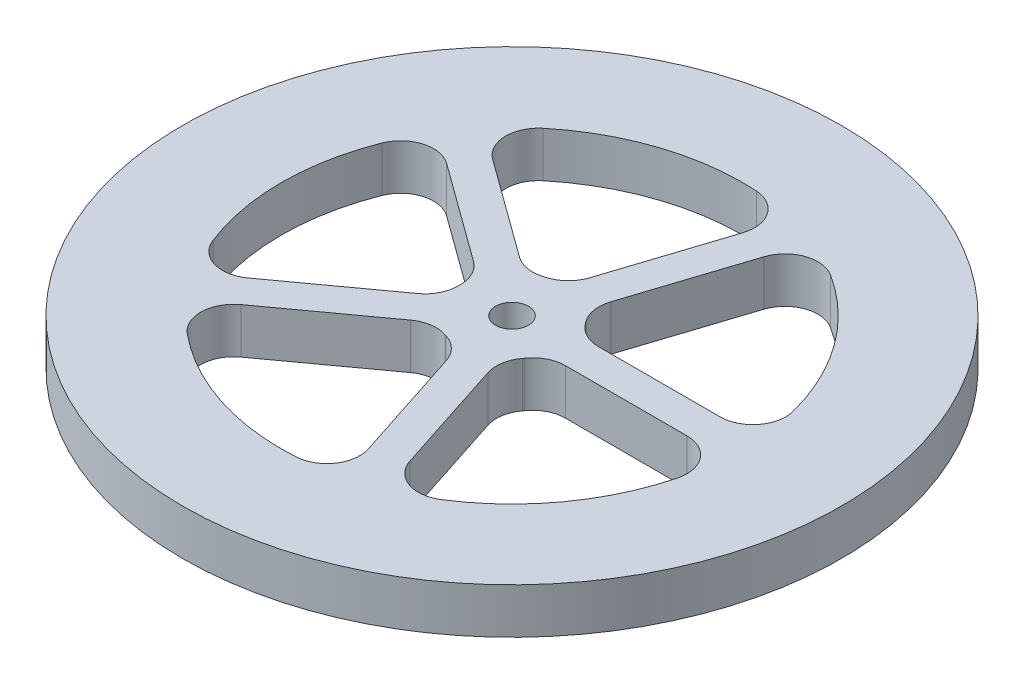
from build123d import *

# Parameters (mm, degrees)
SKETCH1_R           = 63.5
SKETCH1_R_2         = 3.175
BOSS_EXTRUDE1_DEPTH = 8.763
CUT_EXTRUDE1_DEPTH  = 91.229098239


with BuildPart() as part:
    # Sketch1 → Boss-Extrude1 (new body)
    with BuildSketch(Plane(origin=(0, 0, 0), x_dir=(1, 0, 0), z_dir=(0, 1, 0))):
        with Locations(Location((0, 0, 0), (0, 0, 270))):
            Circle(SKETCH1_R)
        with Locations(Location((0, 0, 0), (0, 0, 270))):
            Circle(SKETCH1_R_2, mode=Mode.SUBTRACT)
    extrude(amount=BOSS_EXTRUDE1_DEPTH)

    # Sketch2 → Cut-Extrude1 (cut, through all)
    with BuildSketch(Plane(origin=(0, 8.763, 0), x_dir=(1, 0, 0), z_dir=(0, 1, 0))):
        with BuildLine():
            Line((8.139085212, 6.081191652), (8.298672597, 5.861538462))
            ThreePointArc((8.298672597, 5.861538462), (10.564767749, 3.886494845), (13.485342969, 3.175))
            Line((13.485342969, 3.175), (36.890166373, 3.175))
            ThreePointArc((36.890166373, 3.175), (41.910282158, 5.636435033), (43.038527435, 11.1125))
            ThreePointArc((43.038527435, 11.1125), (35.9608054, 26.127054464), (23.868251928, 37.498120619))
            ThreePointArc((23.868251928, 37.498120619), (18.311557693, 38.117292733), (14.419292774, 34.103504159))
            Line((14.419292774, 34.103504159), (7.186804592, 11.844194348))
            ThreePointArc((7.186804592, 11.844194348), (6.960969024, 8.846698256), (8.139085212, 6.081191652))
        make_face()
        with BuildLine():
            Line((8.298672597, -5.861538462), (8.139085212, -6.081191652))
            ThreePointArc((8.139085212, -6.081191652), (6.960969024, -8.846698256), (7.186804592, -11.844194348))
            Line((7.186804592, -11.844194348), (14.419292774, -34.103504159))
            ThreePointArc((14.419292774, -34.103504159), (18.311557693, -38.117292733), (23.868251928, -37.498120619))
            ThreePointArc((23.868251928, -37.498120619), (35.9608054, -26.127054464), (43.038527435, -11.1125))
            ThreePointArc((43.038527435, -11.1125), (41.910282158, -5.636435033), (36.890166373, -3.175))
            Line((36.890166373, -3.175), (13.485342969, -3.175))
            ThreePointArc((13.485342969, -3.175), (10.564767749, -3.886494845), (8.298672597, -5.861538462))
        make_face()
        with BuildLine():
            Line((-3.010223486, -9.703821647), (-3.268441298, -9.619921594))
            ThreePointArc((-3.268441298, -9.619921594), (-6.262652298, -9.354055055), (-9.043653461, -10.495114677))
            Line((-9.043653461, -10.495114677), (-27.978553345, -24.252124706))
            ThreePointArc((-27.978553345, -24.252124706), (-30.593117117, -29.194217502), (-28.287136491, -34.287613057))
            ThreePointArc((-28.287136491, -34.287613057), (-13.7358054, -42.274462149), (2.731020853, -44.366023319))
            ThreePointArc((2.731020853, -44.366023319), (7.590421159, -41.600801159), (8.380083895, -36.065762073))
            Line((8.380083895, -36.065762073), (1.147595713, -13.806452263))
            ThreePointArc((1.147595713, -13.806452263), (-0.431583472, -11.248684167), (-3.010223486, -9.703821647))
        make_face()
        with BuildLine():
            Line((-10.159093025, -0.135753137), (-10.159093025, 0.135753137))
            ThreePointArc((-10.159093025, 0.135753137), (-10.831501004, 3.065574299), (-12.776089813, 5.357856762))
            Line((-12.776089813, 5.357856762), (-31.710989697, 19.114866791))
            ThreePointArc((-31.710989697, 19.114866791), (-37.219143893, 20.074274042), (-41.350663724, 16.307210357))
            ThreePointArc((-41.350663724, 16.307210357), (-44.45, 0), (-41.350663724, -16.307210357))
            ThreePointArc((-41.350663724, -16.307210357), (-37.219143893, -20.074274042), (-31.710989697, -19.114866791))
            Line((-31.710989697, -19.114866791), (-12.776089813, -5.357856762))
            ThreePointArc((-12.776089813, -5.357856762), (-10.831501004, -3.065574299), (-10.159093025, -0.135753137))
        make_face()
        with BuildLine():
            Line((-3.268441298, 9.619921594), (-3.010223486, 9.703821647))
            ThreePointArc((-3.010223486, 9.703821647), (-0.431583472, 11.248684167), (1.147595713, 13.806452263))
            Line((1.147595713, 13.806452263), (8.380083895, 36.065762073))
            ThreePointArc((8.380083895, 36.065762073), (7.590421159, 41.600801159), (2.731020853, 44.366023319))
            ThreePointArc((2.731020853, 44.366023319), (-13.7358054, 42.274462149), (-28.287136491, 34.287613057))
            ThreePointArc((-28.287136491, 34.287613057), (-30.593117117, 29.194217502), (-27.978553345, 24.252124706))
            Line((-27.978553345, 24.252124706), (-9.043653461, 10.495114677))
            ThreePointArc((-9.043653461, 10.495114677), (-6.262652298, 9.354055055), (-3.268441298, 9.619921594))
        make_face()
    extrude(amount=-CUT_EXTRUDE1_DEPTH, mode=Mode.SUBTRACT)


solid = part.part
